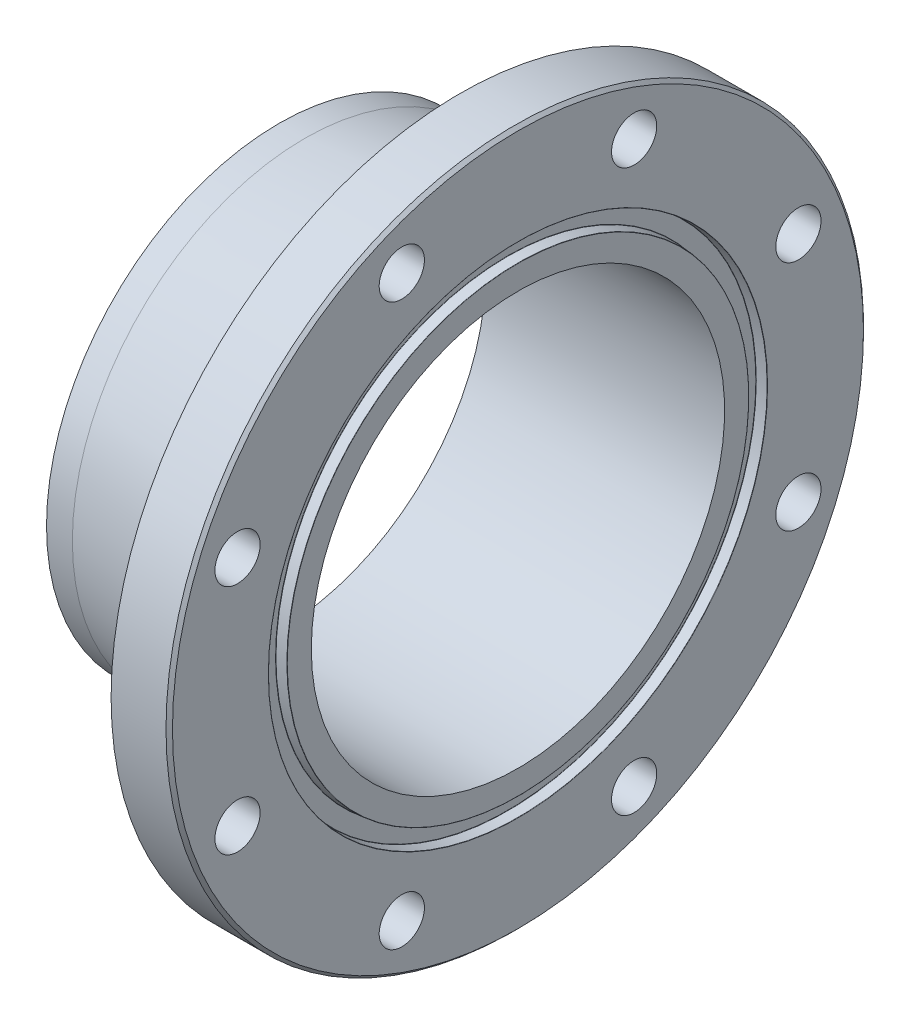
from build123d import *

# Parameters (mm, degrees)
CIRPATTERN1_COUNT = 8
FILLET1_R         = 9.525
CHAMFER1_SIZE     = 1.5875


with BuildPart() as part:
    # Sketch1 → Revolve1 (revolve)
    with BuildSketch(Plane(origin=(0, 0, 0), x_dir=(1, 0, 0), z_dir=(0, 1, 0)), mode=Mode.PRIVATE) as revolve1_sk:
        with BuildLine():
            Line((0, 101.6), (117.475, 101.6))
            Line((117.475, 101.6), (117.475, 113.419461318))
            ThreePointArc((117.475, 113.419461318), (117.441634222, 113.505261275), (117.359068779, 113.545978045))
            Line((117.359068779, 113.545978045), (112.485531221, 113.972357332))
            ThreePointArc((112.485531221, 113.972357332), (112.402965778, 114.013074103), (112.3696, 114.098874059))
            Line((112.3696, 114.098874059), (112.3696, 122.044925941))
            ThreePointArc((112.3696, 122.044925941), (112.402965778, 122.130725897), (112.485531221, 122.171442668))
            Line((112.485531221, 122.171442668), (117.359068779, 122.597821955))
            ThreePointArc((117.359068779, 122.597821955), (117.441634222, 122.638538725), (117.475, 122.724338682))
            Line((117.475, 122.724338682), (117.475, 171.45))
            Line((117.475, 171.45), (88.9, 171.45))
            Line((88.9, 171.45), (88.9, 123.825))
            Line((88.9, 123.825), (12.7, 114.3))
            Line((12.7, 114.3), (0, 114.3))
            Line((0, 114.3), (0, 101.6))
        make_face()
    revolve(revolve1_sk.sketch.rotate(Axis((0, 0, 0), (1, 0, 0)), 180), axis=Axis((0, 0, 0), (1, 0, 0)))

    # Sketch4 → 7_8 _0.875_ Diameter Hole1 (revolve, cut)
    with BuildSketch(Plane(origin=(117.475, 57.105935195, 137.865923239), x_dir=(0, 0, -1), z_dir=(0, 1, 0))):
        Polygon((0, 0), (0, 82.877063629), (11.1125, 76.2), (11.1125, 0), align=None)
    f_7_8_0_875_diameter_hole1 = revolve(axis=Axis((123.825, 57.105935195, 137.865923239), (-1, 0, 0)), mode=Mode.SUBTRACT)

    # CirPattern1: 7_8 _0.875_ Diameter Hole1 ×8 about axis
    cirpattern1_axis = Axis((0, 0, 0), (1, 0, 0))
    for i in range(1, CIRPATTERN1_COUNT):
        add(f_7_8_0_875_diameter_hole1.rotate(cirpattern1_axis, i * 360 / CIRPATTERN1_COUNT), mode=Mode.SUBTRACT)

    # Fillet1
    fillet1_edges = [part.edges().sort_by_distance(p)[0] for p in [
        (88.9, 0, -123.825),
    ]]
    fillet(fillet1_edges, radius=FILLET1_R)

    # Chamfer1
    chamfer1_edges = [part.edges().sort_by_distance(p)[0] for p in [
        (117.475, 0, -171.45),
    ]]
    chamfer(chamfer1_edges, length=CHAMFER1_SIZE)


solid = part.part
